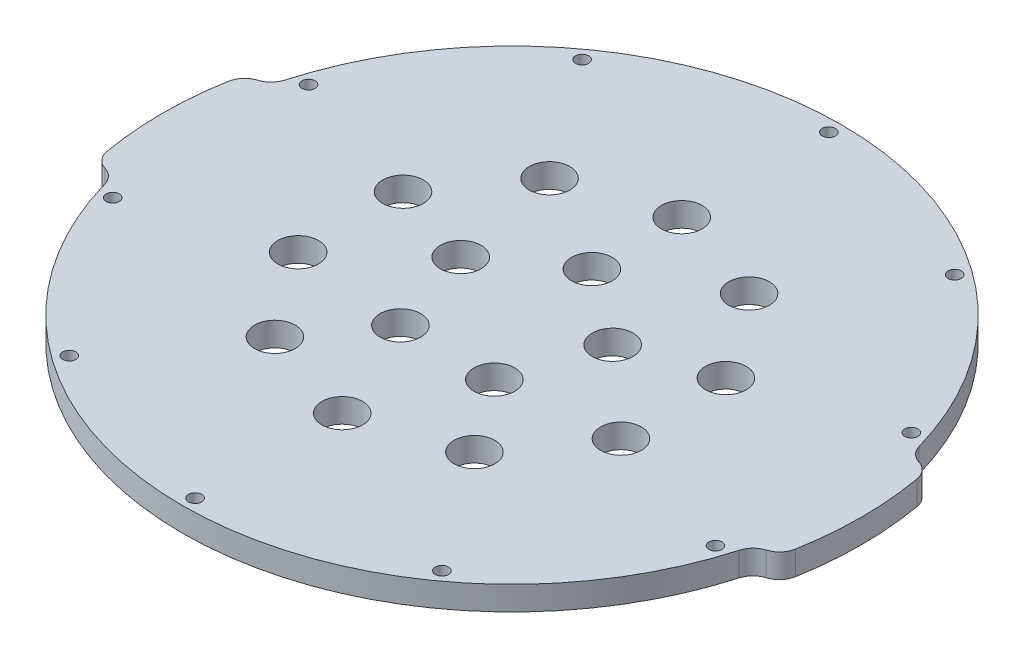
ISO-10303-21;
HEADER;
FILE_DESCRIPTION(('STEP AP214'),'2;1');
FILE_NAME('part.step','',(''),(''),'','','');
FILE_SCHEMA(('AUTOMOTIVE_DESIGN { 1 0 10303 214 1 1 1 1 }'));
ENDSEC;
DATA;
#1=APPLICATION_CONTEXT('core data for automotive mechanical design processes');
#2=APPLICATION_PROTOCOL_DEFINITION('international standard','automotive_design',2000,#1);
#3=PRODUCT_CONTEXT('',#1,'mechanical');
#4=PRODUCT('Part','Part','',(#3));
#5=PRODUCT_RELATED_PRODUCT_CATEGORY('part','',(#4));
#6=PRODUCT_DEFINITION_FORMATION('','',#4);
#7=PRODUCT_DEFINITION_CONTEXT('part definition',#1,'design');
#8=PRODUCT_DEFINITION('design','',#6,#7);
#9=PRODUCT_DEFINITION_SHAPE('','',#8);
#10=(LENGTH_UNIT() NAMED_UNIT(*) SI_UNIT(.MILLI.,.METRE.));
#11=(NAMED_UNIT(*) PLANE_ANGLE_UNIT() SI_UNIT($,.RADIAN.));
#12=(NAMED_UNIT(*) SI_UNIT($,.STERADIAN.) SOLID_ANGLE_UNIT());
#13=UNCERTAINTY_MEASURE_WITH_UNIT(LENGTH_MEASURE(1.E-05),#10,'distance_accuracy_value','');
#14=(GEOMETRIC_REPRESENTATION_CONTEXT(3) GLOBAL_UNCERTAINTY_ASSIGNED_CONTEXT((#13)) GLOBAL_UNIT_ASSIGNED_CONTEXT((#10,
#11,#12)) REPRESENTATION_CONTEXT('',''));
#15=CARTESIAN_POINT('',(0.,0.,0.));
#16=DIRECTION('',(0.,0.,1.));
#17=DIRECTION('',(1.,0.,0.));
#18=AXIS2_PLACEMENT_3D('',#15,#16,#17);
#19=CARTESIAN_POINT('',(-40.6479400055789,6.,-7.16732853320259));
#20=DIRECTION('',(0.,-1.,0.));
#21=DIRECTION('',(0.,0.,-1.));
#22=AXIS2_PLACEMENT_3D('',#19,#20,#21);
#23=PLANE('',#22);
#24=CARTESIAN_POINT('',(19.0211303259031,6.,-6.18033988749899));
#25=DIRECTION('',(0.,1.,0.));
#26=DIRECTION('',(0.,0.,1.));
#27=AXIS2_PLACEMENT_3D('',#24,#25,#26);
#28=CIRCLE('',#27,5.1);
#29=CARTESIAN_POINT('',(19.0211303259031,6.,-1.08033988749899));
#30=VERTEX_POINT('',#29);
#31=EDGE_CURVE('E456',#30,#30,#28,.T.);
#32=ORIENTED_EDGE('',*,*,#31,.F.);
#33=EDGE_LOOP('',(#32));
#34=FACE_BOUND('',#33,.T.);
#35=CARTESIAN_POINT('',(0.,6.,-20.));
#36=DIRECTION('',(0.,1.,0.));
#37=DIRECTION('',(0.,0.,1.));
#38=AXIS2_PLACEMENT_3D('',#35,#36,#37);
#39=CIRCLE('',#38,5.1);
#40=CARTESIAN_POINT('',(0.,6.,-14.9));
#41=VERTEX_POINT('',#40);
#42=EDGE_CURVE('E450',#41,#41,#39,.T.);
#43=ORIENTED_EDGE('',*,*,#42,.F.);
#44=EDGE_LOOP('',(#43));
#45=FACE_BOUND('',#44,.T.);
#46=CARTESIAN_POINT('',(-19.0211303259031,6.,-6.1803398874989));
#47=DIRECTION('',(0.,1.,0.));
#48=DIRECTION('',(0.,0.,1.));
#49=AXIS2_PLACEMENT_3D('',#46,#47,#48);
#50=CIRCLE('',#49,5.1);
#51=CARTESIAN_POINT('',(-19.0211303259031,6.,-1.08033988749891));
#52=VERTEX_POINT('',#51);
#53=EDGE_CURVE('E444',#52,#52,#50,.T.);
#54=ORIENTED_EDGE('',*,*,#53,.F.);
#55=EDGE_LOOP('',(#54));
#56=FACE_BOUND('',#55,.T.);
#57=CARTESIAN_POINT('',(-11.7557050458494,6.,16.180339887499));
#58=DIRECTION('',(0.,1.,0.));
#59=DIRECTION('',(0.,0.,1.));
#60=AXIS2_PLACEMENT_3D('',#57,#58,#59);
#61=CIRCLE('',#60,5.1);
#62=CARTESIAN_POINT('',(-11.7557050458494,6.,21.280339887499));
#63=VERTEX_POINT('',#62);
#64=EDGE_CURVE('E438',#63,#63,#61,.T.);
#65=ORIENTED_EDGE('',*,*,#64,.F.);
#66=EDGE_LOOP('',(#65));
#67=FACE_BOUND('',#66,.T.);
#68=CARTESIAN_POINT('',(-24.9808732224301,6.,-34.3832222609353));
#69=DIRECTION('',(0.,1.,0.));
#70=DIRECTION('',(0.,0.,1.));
#71=AXIS2_PLACEMENT_3D('',#68,#69,#70);
#72=CIRCLE('',#71,5.1);
#73=CARTESIAN_POINT('',(-24.9808732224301,6.,-29.2832222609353));
#74=VERTEX_POINT('',#73);
#75=EDGE_CURVE('E432',#74,#74,#72,.T.);
#76=ORIENTED_EDGE('',*,*,#75,.F.);
#77=EDGE_LOOP('',(#76));
#78=FACE_BOUND('',#77,.T.);
#79=CARTESIAN_POINT('',(-40.419901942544,6.,-13.1332222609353));
#80=DIRECTION('',(0.,1.,0.));
#81=DIRECTION('',(0.,0.,1.));
#82=AXIS2_PLACEMENT_3D('',#79,#80,#81);
#83=CIRCLE('',#82,5.1);
#84=CARTESIAN_POINT('',(-40.419901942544,6.,-8.03322226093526));
#85=VERTEX_POINT('',#84);
#86=EDGE_CURVE('E426',#85,#85,#83,.T.);
#87=ORIENTED_EDGE('',*,*,#86,.F.);
#88=EDGE_LOOP('',(#87));
#89=FACE_BOUND('',#88,.T.);
#90=CARTESIAN_POINT('',(-40.419901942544,6.,13.1332222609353));
#91=DIRECTION('',(0.,1.,0.));
#92=DIRECTION('',(0.,0.,1.));
#93=AXIS2_PLACEMENT_3D('',#90,#91,#92);
#94=CIRCLE('',#93,5.09999999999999);
#95=CARTESIAN_POINT('',(-40.419901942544,6.,18.2332222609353));
#96=VERTEX_POINT('',#95);
#97=EDGE_CURVE('E420',#96,#96,#94,.T.);
#98=ORIENTED_EDGE('',*,*,#97,.F.);
#99=EDGE_LOOP('',(#98));
#100=FACE_BOUND('',#99,.T.);
#101=CARTESIAN_POINT('',(-24.9808732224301,6.,34.3832222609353));
#102=DIRECTION('',(0.,1.,0.));
#103=DIRECTION('',(0.,0.,1.));
#104=AXIS2_PLACEMENT_3D('',#101,#102,#103);
#105=CIRCLE('',#104,5.1);
#106=CARTESIAN_POINT('',(-24.9808732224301,6.,39.4832222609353));
#107=VERTEX_POINT('',#106);
#108=EDGE_CURVE('E414',#107,#107,#105,.T.);
#109=ORIENTED_EDGE('',*,*,#108,.F.);
#110=EDGE_LOOP('',(#109));
#111=FACE_BOUND('',#110,.T.);
#112=CARTESIAN_POINT('',(0.,6.,42.5));
#113=DIRECTION('',(0.,1.,0.));
#114=DIRECTION('',(0.,0.,1.));
#115=AXIS2_PLACEMENT_3D('',#112,#113,#114);
#116=CIRCLE('',#115,5.1);
#117=CARTESIAN_POINT('',(0.,6.,47.6));
#118=VERTEX_POINT('',#117);
#119=EDGE_CURVE('E408',#118,#118,#116,.T.);
#120=ORIENTED_EDGE('',*,*,#119,.F.);
#121=EDGE_LOOP('',(#120));
#122=FACE_BOUND('',#121,.T.);
#123=CARTESIAN_POINT('',(11.7557050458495,6.,16.1803398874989));
#124=DIRECTION('',(0.,1.,0.));
#125=DIRECTION('',(0.,0.,1.));
#126=AXIS2_PLACEMENT_3D('',#123,#124,#125);
#127=CIRCLE('',#126,5.1);
#128=CARTESIAN_POINT('',(11.7557050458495,6.,21.2803398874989));
#129=VERTEX_POINT('',#128);
#130=EDGE_CURVE('E402',#129,#129,#127,.T.);
#131=ORIENTED_EDGE('',*,*,#130,.F.);
#132=EDGE_LOOP('',(#131));
#133=FACE_BOUND('',#132,.T.);
#134=CARTESIAN_POINT('',(24.9808732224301,6.,34.3832222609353));
#135=DIRECTION('',(0.,1.,0.));
#136=DIRECTION('',(0.,0.,1.));
#137=AXIS2_PLACEMENT_3D('',#134,#135,#136);
#138=CIRCLE('',#137,5.1);
#139=CARTESIAN_POINT('',(24.9808732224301,6.,39.4832222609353));
#140=VERTEX_POINT('',#139);
#141=EDGE_CURVE('E396',#140,#140,#138,.T.);
#142=ORIENTED_EDGE('',*,*,#141,.F.);
#143=EDGE_LOOP('',(#142));
#144=FACE_BOUND('',#143,.T.);
#145=CARTESIAN_POINT('',(40.419901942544,6.,13.1332222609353));
#146=DIRECTION('',(0.,1.,0.));
#147=DIRECTION('',(0.,0.,1.));
#148=AXIS2_PLACEMENT_3D('',#145,#146,#147);
#149=CIRCLE('',#148,5.10000000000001);
#150=CARTESIAN_POINT('',(40.419901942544,6.,18.2332222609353));
#151=VERTEX_POINT('',#150);
#152=EDGE_CURVE('E390',#151,#151,#149,.T.);
#153=ORIENTED_EDGE('',*,*,#152,.F.);
#154=EDGE_LOOP('',(#153));
#155=FACE_BOUND('',#154,.T.);
#156=CARTESIAN_POINT('',(40.419901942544,6.,-13.1332222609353));
#157=DIRECTION('',(0.,1.,0.));
#158=DIRECTION('',(0.,0.,1.));
#159=AXIS2_PLACEMENT_3D('',#156,#157,#158);
#160=CIRCLE('',#159,5.1);
#161=CARTESIAN_POINT('',(40.419901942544,6.,-8.03322226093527));
#162=VERTEX_POINT('',#161);
#163=EDGE_CURVE('E384',#162,#162,#160,.T.);
#164=ORIENTED_EDGE('',*,*,#163,.F.);
#165=EDGE_LOOP('',(#164));
#166=FACE_BOUND('',#165,.T.);
#167=CARTESIAN_POINT('',(24.9808732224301,6.,-34.3832222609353));
#168=DIRECTION('',(0.,1.,0.));
#169=DIRECTION('',(0.,0.,1.));
#170=AXIS2_PLACEMENT_3D('',#167,#168,#169);
#171=CIRCLE('',#170,5.1);
#172=CARTESIAN_POINT('',(24.9808732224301,6.,-29.2832222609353));
#173=VERTEX_POINT('',#172);
#174=EDGE_CURVE('E378',#173,#173,#171,.T.);
#175=ORIENTED_EDGE('',*,*,#174,.F.);
#176=EDGE_LOOP('',(#175));
#177=FACE_BOUND('',#176,.T.);
#178=CARTESIAN_POINT('',(0.,6.,-42.5));
#179=DIRECTION('',(0.,1.,0.));
#180=DIRECTION('',(0.,0.,1.));
#181=AXIS2_PLACEMENT_3D('',#178,#179,#180);
#182=CIRCLE('',#181,5.1);
#183=CARTESIAN_POINT('',(0.,6.,-37.4));
#184=VERTEX_POINT('',#183);
#185=EDGE_CURVE('E372',#184,#184,#182,.T.);
#186=ORIENTED_EDGE('',*,*,#185,.F.);
#187=EDGE_LOOP('',(#186));
#188=FACE_BOUND('',#187,.T.);
#189=CARTESIAN_POINT('',(-75.4663345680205,6.,-24.5204985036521));
#190=DIRECTION('',(0.,1.,0.));
#191=DIRECTION('',(0.,0.,1.));
#192=AXIS2_PLACEMENT_3D('',#189,#190,#191);
#193=CIRCLE('',#192,1.6500000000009);
#194=CARTESIAN_POINT('',(-75.4663345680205,6.,-22.8704985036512));
#195=VERTEX_POINT('',#194);
#196=EDGE_CURVE('E357',#195,#195,#193,.T.);
#197=ORIENTED_EDGE('',*,*,#196,.F.);
#198=EDGE_LOOP('',(#197));
#199=FACE_BOUND('',#198,.T.);
#200=CARTESIAN_POINT('',(-46.6407597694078,6.,64.1954985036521));
#201=DIRECTION('',(0.,1.,0.));
#202=DIRECTION('',(0.,0.,1.));
#203=AXIS2_PLACEMENT_3D('',#200,#201,#202);
#204=CIRCLE('',#203,1.65000000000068);
#205=CARTESIAN_POINT('',(-46.6407597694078,6.,65.8454985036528));
#206=VERTEX_POINT('',#205);
#207=EDGE_CURVE('E345',#206,#206,#204,.T.);
#208=ORIENTED_EDGE('',*,*,#207,.F.);
#209=EDGE_LOOP('',(#208));
#210=FACE_BOUND('',#209,.T.);
#211=CARTESIAN_POINT('',(46.6407597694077,6.,64.1954985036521));
#212=DIRECTION('',(0.,1.,0.));
#213=DIRECTION('',(0.,0.,1.));
#214=AXIS2_PLACEMENT_3D('',#211,#212,#213);
#215=CIRCLE('',#214,1.65000000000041);
#216=CARTESIAN_POINT('',(46.6407597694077,6.,65.8454985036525));
#217=VERTEX_POINT('',#216);
#218=EDGE_CURVE('E333',#217,#217,#215,.T.);
#219=ORIENTED_EDGE('',*,*,#218,.F.);
#220=EDGE_LOOP('',(#219));
#221=FACE_BOUND('',#220,.T.);
#222=CARTESIAN_POINT('',(75.4663345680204,6.,-24.5204985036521));
#223=DIRECTION('',(0.,1.,0.));
#224=DIRECTION('',(0.,0.,1.));
#225=AXIS2_PLACEMENT_3D('',#222,#223,#224);
#226=CIRCLE('',#225,1.65000000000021);
#227=CARTESIAN_POINT('',(75.4663345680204,6.,-22.8704985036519));
#228=VERTEX_POINT('',#227);
#229=EDGE_CURVE('E321',#228,#228,#226,.T.);
#230=ORIENTED_EDGE('',*,*,#229,.F.);
#231=EDGE_LOOP('',(#230));
#232=FACE_BOUND('',#231,.T.);
#233=CARTESIAN_POINT('',(0.,6.,-79.35));
#234=DIRECTION('',(0.,1.,0.));
#235=DIRECTION('',(0.,0.,1.));
#236=AXIS2_PLACEMENT_3D('',#233,#234,#235);
#237=CIRCLE('',#236,1.65);
#238=CARTESIAN_POINT('',(0.,6.,-77.7));
#239=VERTEX_POINT('',#238);
#240=EDGE_CURVE('E289',#239,#239,#237,.T.);
#241=ORIENTED_EDGE('',*,*,#240,.F.);
#242=EDGE_LOOP('',(#241));
#243=FACE_BOUND('',#242,.T.);
#244=CARTESIAN_POINT('',(0.,6.,0.));
#245=DIRECTION('',(0.,1.,0.));
#246=DIRECTION('',(0.,0.,-1.));
#247=AXIS2_PLACEMENT_3D('',#244,#245,#246);
#248=CIRCLE('',#247,82.55);
#249=CARTESIAN_POINT('',(79.4156922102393,6.,-22.5310969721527));
#250=VERTEX_POINT('',#249);
#251=CARTESIAN_POINT('',(-79.4156922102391,6.,-22.531096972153));
#252=VERTEX_POINT('',#251);
#253=EDGE_CURVE('E284',#250,#252,#248,.T.);
#254=ORIENTED_EDGE('',*,*,#253,.T.);
#255=CARTESIAN_POINT('',(-84.2258492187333,6.,-23.8957909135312));
#256=DIRECTION('',(0.,-1.,0.));
#257=DIRECTION('',(0.,0.,-1.));
#258=AXIS2_PLACEMENT_3D('',#255,#256,#257);
#259=CIRCLE('',#258,5.);
#260=CARTESIAN_POINT('',(-82.7608646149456,6.,-19.1152239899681));
#261=VERTEX_POINT('',#260);
#262=EDGE_CURVE('E139',#252,#261,#259,.T.);
#263=ORIENTED_EDGE('',*,*,#262,.T.);
#264=CARTESIAN_POINT('',(-81.2958800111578,6.,-14.3346570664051));
#265=DIRECTION('',(0.,1.,0.));
#266=DIRECTION('',(0.,0.,-1.));
#267=AXIS2_PLACEMENT_3D('',#264,#265,#266);
#268=CIRCLE('',#267,5.00000000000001);
#269=CARTESIAN_POINT('',(-86.2199187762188,6.,-15.2028979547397));
#270=VERTEX_POINT('',#269);
#271=EDGE_CURVE('E132',#261,#270,#268,.T.);
#272=ORIENTED_EDGE('',*,*,#271,.T.);
#273=CARTESIAN_POINT('',(0.,6.,0.));
#274=DIRECTION('',(0.,1.,0.));
#275=DIRECTION('',(0.,0.,-1.));
#276=AXIS2_PLACEMENT_3D('',#273,#274,#275);
#277=CIRCLE('',#276,87.55);
#278=CARTESIAN_POINT('',(-86.2199187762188,6.,15.2028979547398));
#279=VERTEX_POINT('',#278);
#280=EDGE_CURVE('E136',#270,#279,#277,.T.);
#281=ORIENTED_EDGE('',*,*,#280,.T.);
#282=CARTESIAN_POINT('',(-81.2958800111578,6.,14.3346570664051));
#283=DIRECTION('',(0.,1.,0.));
#284=DIRECTION('',(0.,0.,1.));
#285=AXIS2_PLACEMENT_3D('',#282,#283,#284);
#286=CIRCLE('',#285,5.00000000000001);
#287=CARTESIAN_POINT('',(-82.7608646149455,6.,19.1152239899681));
#288=VERTEX_POINT('',#287);
#289=EDGE_CURVE('E152',#279,#288,#286,.T.);
#290=ORIENTED_EDGE('',*,*,#289,.T.);
#291=CARTESIAN_POINT('',(-84.2258492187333,6.,23.8957909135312));
#292=DIRECTION('',(0.,-1.,0.));
#293=DIRECTION('',(0.,0.,-1.));
#294=AXIS2_PLACEMENT_3D('',#291,#292,#293);
#295=CIRCLE('',#294,5.);
#296=CARTESIAN_POINT('',(-79.4156922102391,6.,22.531096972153));
#297=VERTEX_POINT('',#296);
#298=EDGE_CURVE('E13',#288,#297,#295,.T.);
#299=ORIENTED_EDGE('',*,*,#298,.T.);
#300=CARTESIAN_POINT('',(0.,6.,-4.92661467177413E-13));
#301=DIRECTION('',(0.,1.,0.));
#302=DIRECTION('',(0.,0.,-1.));
#303=AXIS2_PLACEMENT_3D('',#300,#301,#302);
#304=CIRCLE('',#303,82.5500000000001);
#305=CARTESIAN_POINT('',(79.4156922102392,6.,22.5310969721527));
#306=VERTEX_POINT('',#305);
#307=EDGE_CURVE('E271',#297,#306,#304,.T.);
#308=ORIENTED_EDGE('',*,*,#307,.T.);
#309=CARTESIAN_POINT('',(84.2258492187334,6.,23.8957909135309));
#310=DIRECTION('',(0.,-1.,0.));
#311=DIRECTION('',(0.,0.,-1.));
#312=AXIS2_PLACEMENT_3D('',#309,#310,#311);
#313=CIRCLE('',#312,5.);
#314=CARTESIAN_POINT('',(82.7608646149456,6.,19.1152239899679));
#315=VERTEX_POINT('',#314);
#316=EDGE_CURVE('E183',#306,#315,#313,.T.);
#317=ORIENTED_EDGE('',*,*,#316,.T.);
#318=CARTESIAN_POINT('',(81.2958800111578,6.,14.3346570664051));
#319=DIRECTION('',(0.,1.,0.));
#320=DIRECTION('',(0.,0.,-1.));
#321=AXIS2_PLACEMENT_3D('',#318,#319,#320);
#322=CIRCLE('',#321,4.99999999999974);
#323=CARTESIAN_POINT('',(86.2199187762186,6.,15.2028979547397));
#324=VERTEX_POINT('',#323);
#325=EDGE_CURVE('E268',#315,#324,#322,.T.);
#326=ORIENTED_EDGE('',*,*,#325,.T.);
#327=CARTESIAN_POINT('',(-1.29063426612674E-12,6.,0.));
#328=DIRECTION('',(0.,1.,0.));
#329=DIRECTION('',(0.,0.,1.));
#330=AXIS2_PLACEMENT_3D('',#327,#328,#329);
#331=CIRCLE('',#330,87.550000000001);
#332=CARTESIAN_POINT('',(86.2199187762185,6.,-15.2028979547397));
#333=VERTEX_POINT('',#332);
#334=EDGE_CURVE('E275',#324,#333,#331,.T.);
#335=ORIENTED_EDGE('',*,*,#334,.T.);
#336=CARTESIAN_POINT('',(81.2958800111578,6.,-14.3346570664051));
#337=DIRECTION('',(0.,1.,0.));
#338=DIRECTION('',(0.,0.,1.));
#339=AXIS2_PLACEMENT_3D('',#336,#337,#338);
#340=CIRCLE('',#339,4.99999999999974);
#341=CARTESIAN_POINT('',(82.7608646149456,6.,-19.1152239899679));
#342=VERTEX_POINT('',#341);
#343=EDGE_CURVE('E277',#333,#342,#340,.T.);
#344=ORIENTED_EDGE('',*,*,#343,.T.);
#345=CARTESIAN_POINT('',(84.2258492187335,6.,-23.8957909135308));
#346=DIRECTION('',(0.,-1.,0.));
#347=DIRECTION('',(0.,0.,-1.));
#348=AXIS2_PLACEMENT_3D('',#345,#346,#347);
#349=CIRCLE('',#348,5.);
#350=EDGE_CURVE('E187',#342,#250,#349,.T.);
#351=ORIENTED_EDGE('',*,*,#350,.T.);
#352=EDGE_LOOP('',(#254,#263,#272,#281,#290,#299,#308,#317,#326,#335,#344,#351));
#353=FACE_BOUND('',#352,.T.);
#354=CARTESIAN_POINT('',(46.6407597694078,6.,-64.1954985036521));
#355=DIRECTION('',(0.,1.,0.));
#356=DIRECTION('',(0.,0.,1.));
#357=AXIS2_PLACEMENT_3D('',#354,#355,#356);
#358=CIRCLE('',#357,1.65000000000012);
#359=CARTESIAN_POINT('',(46.6407597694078,6.,-62.5454985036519));
#360=VERTEX_POINT('',#359);
#361=EDGE_CURVE('E315',#360,#360,#358,.T.);
#362=ORIENTED_EDGE('',*,*,#361,.F.);
#363=EDGE_LOOP('',(#362));
#364=FACE_BOUND('',#363,.T.);
#365=CARTESIAN_POINT('',(75.4663345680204,6.,24.5204985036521));
#366=DIRECTION('',(0.,1.,0.));
#367=DIRECTION('',(0.,0.,1.));
#368=AXIS2_PLACEMENT_3D('',#365,#366,#367);
#369=CIRCLE('',#368,1.65000000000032);
#370=CARTESIAN_POINT('',(75.4663345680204,6.,26.1704985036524));
#371=VERTEX_POINT('',#370);
#372=EDGE_CURVE('E327',#371,#371,#369,.T.);
#373=ORIENTED_EDGE('',*,*,#372,.F.);
#374=EDGE_LOOP('',(#373));
#375=FACE_BOUND('',#374,.T.);
#376=CARTESIAN_POINT('',(0.,6.,79.35));
#377=DIRECTION('',(0.,1.,0.));
#378=DIRECTION('',(0.,0.,1.));
#379=AXIS2_PLACEMENT_3D('',#376,#377,#378);
#380=CIRCLE('',#379,1.65000000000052);
#381=CARTESIAN_POINT('',(0.,6.,81.0000000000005));
#382=VERTEX_POINT('',#381);
#383=EDGE_CURVE('E339',#382,#382,#380,.T.);
#384=ORIENTED_EDGE('',*,*,#383,.F.);
#385=EDGE_LOOP('',(#384));
#386=FACE_BOUND('',#385,.T.);
#387=CARTESIAN_POINT('',(-75.4663345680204,6.,24.5204985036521));
#388=DIRECTION('',(0.,1.,0.));
#389=DIRECTION('',(0.,0.,1.));
#390=AXIS2_PLACEMENT_3D('',#387,#388,#389);
#391=CIRCLE('',#390,1.65000000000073);
#392=CARTESIAN_POINT('',(-75.4663345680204,6.,26.1704985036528));
#393=VERTEX_POINT('',#392);
#394=EDGE_CURVE('E351',#393,#393,#391,.T.);
#395=ORIENTED_EDGE('',*,*,#394,.F.);
#396=EDGE_LOOP('',(#395));
#397=FACE_BOUND('',#396,.T.);
#398=CARTESIAN_POINT('',(-46.6407597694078,6.,-64.1954985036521));
#399=DIRECTION('',(0.,1.,0.));
#400=DIRECTION('',(0.,0.,1.));
#401=AXIS2_PLACEMENT_3D('',#398,#399,#400);
#402=CIRCLE('',#401,1.65000000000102);
#403=CARTESIAN_POINT('',(-46.6407597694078,6.,-62.545498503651));
#404=VERTEX_POINT('',#403);
#405=EDGE_CURVE('E363',#404,#404,#402,.T.);
#406=ORIENTED_EDGE('',*,*,#405,.F.);
#407=EDGE_LOOP('',(#406));
#408=FACE_BOUND('',#407,.T.);
#409=ADVANCED_FACE('F44',(#34,#45,#56,#67,#78,#89,#100,#111,#122,#133,#144,#155,#166,#177,#188,
#199,#210,#221,#232,#243,#353,#364,#375,#386,#397,#408),#23,.F.);
#410=CARTESIAN_POINT('',(-40.6479400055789,0.,-7.16732853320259));
#411=DIRECTION('',(0.,-1.,0.));
#412=DIRECTION('',(0.,0.,-1.));
#413=AXIS2_PLACEMENT_3D('',#410,#411,#412);
#414=PLANE('',#413);
#415=CARTESIAN_POINT('',(19.0211303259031,0.,-6.18033988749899));
#416=DIRECTION('',(0.,1.,0.));
#417=DIRECTION('',(0.,0.,1.));
#418=AXIS2_PLACEMENT_3D('',#415,#416,#417);
#419=CIRCLE('',#418,5.1);
#420=CARTESIAN_POINT('',(19.0211303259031,0.,-1.08033988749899));
#421=VERTEX_POINT('',#420);
#422=EDGE_CURVE('E453',#421,#421,#419,.T.);
#423=ORIENTED_EDGE('',*,*,#422,.T.);
#424=EDGE_LOOP('',(#423));
#425=FACE_BOUND('',#424,.T.);
#426=CARTESIAN_POINT('',(0.,0.,-20.));
#427=DIRECTION('',(0.,1.,0.));
#428=DIRECTION('',(0.,0.,1.));
#429=AXIS2_PLACEMENT_3D('',#426,#427,#428);
#430=CIRCLE('',#429,5.1);
#431=CARTESIAN_POINT('',(0.,0.,-14.9));
#432=VERTEX_POINT('',#431);
#433=EDGE_CURVE('E447',#432,#432,#430,.T.);
#434=ORIENTED_EDGE('',*,*,#433,.T.);
#435=EDGE_LOOP('',(#434));
#436=FACE_BOUND('',#435,.T.);
#437=CARTESIAN_POINT('',(-19.0211303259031,0.,-6.1803398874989));
#438=DIRECTION('',(0.,1.,0.));
#439=DIRECTION('',(0.,0.,1.));
#440=AXIS2_PLACEMENT_3D('',#437,#438,#439);
#441=CIRCLE('',#440,5.1);
#442=CARTESIAN_POINT('',(-19.0211303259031,0.,-1.08033988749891));
#443=VERTEX_POINT('',#442);
#444=EDGE_CURVE('E441',#443,#443,#441,.T.);
#445=ORIENTED_EDGE('',*,*,#444,.T.);
#446=EDGE_LOOP('',(#445));
#447=FACE_BOUND('',#446,.T.);
#448=CARTESIAN_POINT('',(-11.7557050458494,0.,16.180339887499));
#449=DIRECTION('',(0.,1.,0.));
#450=DIRECTION('',(0.,0.,1.));
#451=AXIS2_PLACEMENT_3D('',#448,#449,#450);
#452=CIRCLE('',#451,5.1);
#453=CARTESIAN_POINT('',(-11.7557050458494,0.,21.280339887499));
#454=VERTEX_POINT('',#453);
#455=EDGE_CURVE('E435',#454,#454,#452,.T.);
#456=ORIENTED_EDGE('',*,*,#455,.T.);
#457=EDGE_LOOP('',(#456));
#458=FACE_BOUND('',#457,.T.);
#459=CARTESIAN_POINT('',(-24.9808732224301,0.,-34.3832222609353));
#460=DIRECTION('',(0.,1.,0.));
#461=DIRECTION('',(0.,0.,1.));
#462=AXIS2_PLACEMENT_3D('',#459,#460,#461);
#463=CIRCLE('',#462,5.1);
#464=CARTESIAN_POINT('',(-24.9808732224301,0.,-29.2832222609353));
#465=VERTEX_POINT('',#464);
#466=EDGE_CURVE('E429',#465,#465,#463,.T.);
#467=ORIENTED_EDGE('',*,*,#466,.T.);
#468=EDGE_LOOP('',(#467));
#469=FACE_BOUND('',#468,.T.);
#470=CARTESIAN_POINT('',(-40.419901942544,0.,-13.1332222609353));
#471=DIRECTION('',(0.,1.,0.));
#472=DIRECTION('',(0.,0.,1.));
#473=AXIS2_PLACEMENT_3D('',#470,#471,#472);
#474=CIRCLE('',#473,5.1);
#475=CARTESIAN_POINT('',(-40.419901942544,0.,-8.03322226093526));
#476=VERTEX_POINT('',#475);
#477=EDGE_CURVE('E423',#476,#476,#474,.T.);
#478=ORIENTED_EDGE('',*,*,#477,.T.);
#479=EDGE_LOOP('',(#478));
#480=FACE_BOUND('',#479,.T.);
#481=CARTESIAN_POINT('',(-40.419901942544,0.,13.1332222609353));
#482=DIRECTION('',(0.,1.,0.));
#483=DIRECTION('',(0.,0.,1.));
#484=AXIS2_PLACEMENT_3D('',#481,#482,#483);
#485=CIRCLE('',#484,5.09999999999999);
#486=CARTESIAN_POINT('',(-40.419901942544,0.,18.2332222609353));
#487=VERTEX_POINT('',#486);
#488=EDGE_CURVE('E417',#487,#487,#485,.T.);
#489=ORIENTED_EDGE('',*,*,#488,.T.);
#490=EDGE_LOOP('',(#489));
#491=FACE_BOUND('',#490,.T.);
#492=CARTESIAN_POINT('',(-24.9808732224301,0.,34.3832222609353));
#493=DIRECTION('',(0.,1.,0.));
#494=DIRECTION('',(0.,0.,1.));
#495=AXIS2_PLACEMENT_3D('',#492,#493,#494);
#496=CIRCLE('',#495,5.1);
#497=CARTESIAN_POINT('',(-24.9808732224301,0.,39.4832222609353));
#498=VERTEX_POINT('',#497);
#499=EDGE_CURVE('E411',#498,#498,#496,.T.);
#500=ORIENTED_EDGE('',*,*,#499,.T.);
#501=EDGE_LOOP('',(#500));
#502=FACE_BOUND('',#501,.T.);
#503=CARTESIAN_POINT('',(0.,0.,42.5));
#504=DIRECTION('',(0.,1.,0.));
#505=DIRECTION('',(0.,0.,1.));
#506=AXIS2_PLACEMENT_3D('',#503,#504,#505);
#507=CIRCLE('',#506,5.1);
#508=CARTESIAN_POINT('',(0.,0.,47.6));
#509=VERTEX_POINT('',#508);
#510=EDGE_CURVE('E405',#509,#509,#507,.T.);
#511=ORIENTED_EDGE('',*,*,#510,.T.);
#512=EDGE_LOOP('',(#511));
#513=FACE_BOUND('',#512,.T.);
#514=CARTESIAN_POINT('',(11.7557050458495,0.,16.1803398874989));
#515=DIRECTION('',(0.,1.,0.));
#516=DIRECTION('',(0.,0.,1.));
#517=AXIS2_PLACEMENT_3D('',#514,#515,#516);
#518=CIRCLE('',#517,5.1);
#519=CARTESIAN_POINT('',(11.7557050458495,0.,21.2803398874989));
#520=VERTEX_POINT('',#519);
#521=EDGE_CURVE('E399',#520,#520,#518,.T.);
#522=ORIENTED_EDGE('',*,*,#521,.T.);
#523=EDGE_LOOP('',(#522));
#524=FACE_BOUND('',#523,.T.);
#525=CARTESIAN_POINT('',(24.9808732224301,0.,34.3832222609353));
#526=DIRECTION('',(0.,1.,0.));
#527=DIRECTION('',(0.,0.,1.));
#528=AXIS2_PLACEMENT_3D('',#525,#526,#527);
#529=CIRCLE('',#528,5.1);
#530=CARTESIAN_POINT('',(24.9808732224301,0.,39.4832222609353));
#531=VERTEX_POINT('',#530);
#532=EDGE_CURVE('E393',#531,#531,#529,.T.);
#533=ORIENTED_EDGE('',*,*,#532,.T.);
#534=EDGE_LOOP('',(#533));
#535=FACE_BOUND('',#534,.T.);
#536=CARTESIAN_POINT('',(40.419901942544,0.,13.1332222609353));
#537=DIRECTION('',(0.,1.,0.));
#538=DIRECTION('',(0.,0.,1.));
#539=AXIS2_PLACEMENT_3D('',#536,#537,#538);
#540=CIRCLE('',#539,5.10000000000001);
#541=CARTESIAN_POINT('',(40.419901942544,0.,18.2332222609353));
#542=VERTEX_POINT('',#541);
#543=EDGE_CURVE('E387',#542,#542,#540,.T.);
#544=ORIENTED_EDGE('',*,*,#543,.T.);
#545=EDGE_LOOP('',(#544));
#546=FACE_BOUND('',#545,.T.);
#547=CARTESIAN_POINT('',(40.419901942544,0.,-13.1332222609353));
#548=DIRECTION('',(0.,1.,0.));
#549=DIRECTION('',(0.,0.,1.));
#550=AXIS2_PLACEMENT_3D('',#547,#548,#549);
#551=CIRCLE('',#550,5.1);
#552=CARTESIAN_POINT('',(40.419901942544,0.,-8.03322226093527));
#553=VERTEX_POINT('',#552);
#554=EDGE_CURVE('E381',#553,#553,#551,.T.);
#555=ORIENTED_EDGE('',*,*,#554,.T.);
#556=EDGE_LOOP('',(#555));
#557=FACE_BOUND('',#556,.T.);
#558=CARTESIAN_POINT('',(24.9808732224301,0.,-34.3832222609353));
#559=DIRECTION('',(0.,1.,0.));
#560=DIRECTION('',(0.,0.,1.));
#561=AXIS2_PLACEMENT_3D('',#558,#559,#560);
#562=CIRCLE('',#561,5.1);
#563=CARTESIAN_POINT('',(24.9808732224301,0.,-29.2832222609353));
#564=VERTEX_POINT('',#563);
#565=EDGE_CURVE('E375',#564,#564,#562,.T.);
#566=ORIENTED_EDGE('',*,*,#565,.T.);
#567=EDGE_LOOP('',(#566));
#568=FACE_BOUND('',#567,.T.);
#569=CARTESIAN_POINT('',(0.,0.,-42.5));
#570=DIRECTION('',(0.,1.,0.));
#571=DIRECTION('',(0.,0.,1.));
#572=AXIS2_PLACEMENT_3D('',#569,#570,#571);
#573=CIRCLE('',#572,5.1);
#574=CARTESIAN_POINT('',(0.,0.,-37.4));
#575=VERTEX_POINT('',#574);
#576=EDGE_CURVE('E369',#575,#575,#573,.T.);
#577=ORIENTED_EDGE('',*,*,#576,.T.);
#578=EDGE_LOOP('',(#577));
#579=FACE_BOUND('',#578,.T.);
#580=CARTESIAN_POINT('',(-75.4663345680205,0.,-24.5204985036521));
#581=DIRECTION('',(0.,1.,0.));
#582=DIRECTION('',(0.,0.,1.));
#583=AXIS2_PLACEMENT_3D('',#580,#581,#582);
#584=CIRCLE('',#583,1.6500000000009);
#585=CARTESIAN_POINT('',(-75.4663345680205,0.,-22.8704985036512));
#586=VERTEX_POINT('',#585);
#587=EDGE_CURVE('E360',#586,#586,#584,.T.);
#588=ORIENTED_EDGE('',*,*,#587,.T.);
#589=EDGE_LOOP('',(#588));
#590=FACE_BOUND('',#589,.T.);
#591=CARTESIAN_POINT('',(-46.6407597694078,0.,64.1954985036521));
#592=DIRECTION('',(0.,1.,0.));
#593=DIRECTION('',(0.,0.,1.));
#594=AXIS2_PLACEMENT_3D('',#591,#592,#593);
#595=CIRCLE('',#594,1.65000000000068);
#596=CARTESIAN_POINT('',(-46.6407597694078,0.,65.8454985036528));
#597=VERTEX_POINT('',#596);
#598=EDGE_CURVE('E348',#597,#597,#595,.T.);
#599=ORIENTED_EDGE('',*,*,#598,.T.);
#600=EDGE_LOOP('',(#599));
#601=FACE_BOUND('',#600,.T.);
#602=CARTESIAN_POINT('',(46.6407597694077,0.,64.1954985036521));
#603=DIRECTION('',(0.,1.,0.));
#604=DIRECTION('',(0.,0.,1.));
#605=AXIS2_PLACEMENT_3D('',#602,#603,#604);
#606=CIRCLE('',#605,1.65000000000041);
#607=CARTESIAN_POINT('',(46.6407597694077,0.,65.8454985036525));
#608=VERTEX_POINT('',#607);
#609=EDGE_CURVE('E336',#608,#608,#606,.T.);
#610=ORIENTED_EDGE('',*,*,#609,.T.);
#611=EDGE_LOOP('',(#610));
#612=FACE_BOUND('',#611,.T.);
#613=CARTESIAN_POINT('',(75.4663345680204,0.,-24.5204985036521));
#614=DIRECTION('',(0.,1.,0.));
#615=DIRECTION('',(0.,0.,1.));
#616=AXIS2_PLACEMENT_3D('',#613,#614,#615);
#617=CIRCLE('',#616,1.65000000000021);
#618=CARTESIAN_POINT('',(75.4663345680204,0.,-22.8704985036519));
#619=VERTEX_POINT('',#618);
#620=EDGE_CURVE('E324',#619,#619,#617,.T.);
#621=ORIENTED_EDGE('',*,*,#620,.T.);
#622=EDGE_LOOP('',(#621));
#623=FACE_BOUND('',#622,.T.);
#624=CARTESIAN_POINT('',(0.,0.,-79.35));
#625=DIRECTION('',(0.,1.,0.));
#626=DIRECTION('',(0.,0.,1.));
#627=AXIS2_PLACEMENT_3D('',#624,#625,#626);
#628=CIRCLE('',#627,1.65);
#629=CARTESIAN_POINT('',(0.,0.,-77.7));
#630=VERTEX_POINT('',#629);
#631=EDGE_CURVE('E312',#630,#630,#628,.T.);
#632=ORIENTED_EDGE('',*,*,#631,.T.);
#633=EDGE_LOOP('',(#632));
#634=FACE_BOUND('',#633,.T.);
#635=CARTESIAN_POINT('',(-81.2958800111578,0.,-14.3346570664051));
#636=DIRECTION('',(0.,1.,0.));
#637=DIRECTION('',(0.,0.,-1.));
#638=AXIS2_PLACEMENT_3D('',#635,#636,#637);
#639=CIRCLE('',#638,5.00000000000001);
#640=CARTESIAN_POINT('',(-82.7608646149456,0.,-19.1152239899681));
#641=VERTEX_POINT('',#640);
#642=CARTESIAN_POINT('',(-86.2199187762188,0.,-15.2028979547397));
#643=VERTEX_POINT('',#642);
#644=EDGE_CURVE('E156',#641,#643,#639,.T.);
#645=ORIENTED_EDGE('',*,*,#644,.F.);
#646=CARTESIAN_POINT('',(-84.2258492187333,0.,-23.8957909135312));
#647=DIRECTION('',(0.,-1.,0.));
#648=DIRECTION('',(0.,0.,-1.));
#649=AXIS2_PLACEMENT_3D('',#646,#647,#648);
#650=CIRCLE('',#649,5.);
#651=CARTESIAN_POINT('',(-79.4156922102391,0.,-22.531096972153));
#652=VERTEX_POINT('',#651);
#653=EDGE_CURVE('E189',#641,#652,#650,.F.);
#654=ORIENTED_EDGE('',*,*,#653,.T.);
#655=CARTESIAN_POINT('',(0.,0.,0.));
#656=DIRECTION('',(0.,1.,0.));
#657=DIRECTION('',(0.,0.,-1.));
#658=AXIS2_PLACEMENT_3D('',#655,#656,#657);
#659=CIRCLE('',#658,82.55);
#660=CARTESIAN_POINT('',(79.4156922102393,0.,-22.5310969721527));
#661=VERTEX_POINT('',#660);
#662=EDGE_CURVE('E144',#661,#652,#659,.T.);
#663=ORIENTED_EDGE('',*,*,#662,.F.);
#664=CARTESIAN_POINT('',(84.2258492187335,0.,-23.8957909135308));
#665=DIRECTION('',(0.,-1.,0.));
#666=DIRECTION('',(0.,0.,-1.));
#667=AXIS2_PLACEMENT_3D('',#664,#665,#666);
#668=CIRCLE('',#667,5.);
#669=CARTESIAN_POINT('',(82.7608646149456,0.,-19.1152239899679));
#670=VERTEX_POINT('',#669);
#671=EDGE_CURVE('E185',#661,#670,#668,.F.);
#672=ORIENTED_EDGE('',*,*,#671,.T.);
#673=CARTESIAN_POINT('',(81.2958800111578,0.,-14.3346570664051));
#674=DIRECTION('',(0.,1.,0.));
#675=DIRECTION('',(0.,0.,1.));
#676=AXIS2_PLACEMENT_3D('',#673,#674,#675);
#677=CIRCLE('',#676,4.99999999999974);
#678=CARTESIAN_POINT('',(86.2199187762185,0.,-15.2028979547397));
#679=VERTEX_POINT('',#678);
#680=EDGE_CURVE('E201',#679,#670,#677,.T.);
#681=ORIENTED_EDGE('',*,*,#680,.F.);
#682=CARTESIAN_POINT('',(-1.29063426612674E-12,0.,0.));
#683=DIRECTION('',(0.,1.,0.));
#684=DIRECTION('',(0.,0.,1.));
#685=AXIS2_PLACEMENT_3D('',#682,#683,#684);
#686=CIRCLE('',#685,87.550000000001);
#687=CARTESIAN_POINT('',(86.2199187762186,0.,15.2028979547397));
#688=VERTEX_POINT('',#687);
#689=EDGE_CURVE('E298',#688,#679,#686,.T.);
#690=ORIENTED_EDGE('',*,*,#689,.F.);
#691=CARTESIAN_POINT('',(81.2958800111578,0.,14.3346570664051));
#692=DIRECTION('',(0.,1.,0.));
#693=DIRECTION('',(0.,0.,-1.));
#694=AXIS2_PLACEMENT_3D('',#691,#692,#693);
#695=CIRCLE('',#694,4.99999999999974);
#696=CARTESIAN_POINT('',(82.7608646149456,0.,19.1152239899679));
#697=VERTEX_POINT('',#696);
#698=EDGE_CURVE('E296',#697,#688,#695,.T.);
#699=ORIENTED_EDGE('',*,*,#698,.F.);
#700=CARTESIAN_POINT('',(84.2258492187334,0.,23.8957909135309));
#701=DIRECTION('',(0.,-1.,0.));
#702=DIRECTION('',(0.,0.,-1.));
#703=AXIS2_PLACEMENT_3D('',#700,#701,#702);
#704=CIRCLE('',#703,5.);
#705=CARTESIAN_POINT('',(79.4156922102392,0.,22.5310969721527));
#706=VERTEX_POINT('',#705);
#707=EDGE_CURVE('E181',#697,#706,#704,.F.);
#708=ORIENTED_EDGE('',*,*,#707,.T.);
#709=CARTESIAN_POINT('',(0.,0.,-4.92661467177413E-13));
#710=DIRECTION('',(0.,1.,0.));
#711=DIRECTION('',(0.,0.,-1.));
#712=AXIS2_PLACEMENT_3D('',#709,#710,#711);
#713=CIRCLE('',#712,82.5500000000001);
#714=CARTESIAN_POINT('',(-79.4156922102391,0.,22.531096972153));
#715=VERTEX_POINT('',#714);
#716=EDGE_CURVE('E293',#715,#706,#713,.T.);
#717=ORIENTED_EDGE('',*,*,#716,.F.);
#718=CARTESIAN_POINT('',(-84.2258492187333,0.,23.8957909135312));
#719=DIRECTION('',(0.,-1.,0.));
#720=DIRECTION('',(0.,0.,-1.));
#721=AXIS2_PLACEMENT_3D('',#718,#719,#720);
#722=CIRCLE('',#721,5.);
#723=CARTESIAN_POINT('',(-82.7608646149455,0.,19.1152239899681));
#724=VERTEX_POINT('',#723);
#725=EDGE_CURVE('E52',#715,#724,#722,.F.);
#726=ORIENTED_EDGE('',*,*,#725,.T.);
#727=CARTESIAN_POINT('',(-81.2958800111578,0.,14.3346570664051));
#728=DIRECTION('',(0.,1.,0.));
#729=DIRECTION('',(0.,0.,1.));
#730=AXIS2_PLACEMENT_3D('',#727,#728,#729);
#731=CIRCLE('',#730,5.00000000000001);
#732=CARTESIAN_POINT('',(-86.2199187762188,0.,15.2028979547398));
#733=VERTEX_POINT('',#732);
#734=EDGE_CURVE('E291',#733,#724,#731,.T.);
#735=ORIENTED_EDGE('',*,*,#734,.F.);
#736=CARTESIAN_POINT('',(0.,0.,0.));
#737=DIRECTION('',(0.,1.,0.));
#738=DIRECTION('',(0.,0.,-1.));
#739=AXIS2_PLACEMENT_3D('',#736,#737,#738);
#740=CIRCLE('',#739,87.55);
#741=EDGE_CURVE('E288',#643,#733,#740,.T.);
#742=ORIENTED_EDGE('',*,*,#741,.F.);
#743=EDGE_LOOP('',(#645,#654,#663,#672,#681,#690,#699,#708,#717,#726,#735,#742));
#744=FACE_BOUND('',#743,.T.);
#745=CARTESIAN_POINT('',(46.6407597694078,0.,-64.1954985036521));
#746=DIRECTION('',(0.,1.,0.));
#747=DIRECTION('',(0.,0.,1.));
#748=AXIS2_PLACEMENT_3D('',#745,#746,#747);
#749=CIRCLE('',#748,1.65000000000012);
#750=CARTESIAN_POINT('',(46.6407597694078,0.,-62.5454985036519));
#751=VERTEX_POINT('',#750);
#752=EDGE_CURVE('E318',#751,#751,#749,.T.);
#753=ORIENTED_EDGE('',*,*,#752,.T.);
#754=EDGE_LOOP('',(#753));
#755=FACE_BOUND('',#754,.T.);
#756=CARTESIAN_POINT('',(75.4663345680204,0.,24.5204985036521));
#757=DIRECTION('',(0.,1.,0.));
#758=DIRECTION('',(0.,0.,1.));
#759=AXIS2_PLACEMENT_3D('',#756,#757,#758);
#760=CIRCLE('',#759,1.65000000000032);
#761=CARTESIAN_POINT('',(75.4663345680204,0.,26.1704985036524));
#762=VERTEX_POINT('',#761);
#763=EDGE_CURVE('E330',#762,#762,#760,.T.);
#764=ORIENTED_EDGE('',*,*,#763,.T.);
#765=EDGE_LOOP('',(#764));
#766=FACE_BOUND('',#765,.T.);
#767=CARTESIAN_POINT('',(0.,0.,79.35));
#768=DIRECTION('',(0.,1.,0.));
#769=DIRECTION('',(0.,0.,1.));
#770=AXIS2_PLACEMENT_3D('',#767,#768,#769);
#771=CIRCLE('',#770,1.65000000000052);
#772=CARTESIAN_POINT('',(0.,0.,81.0000000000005));
#773=VERTEX_POINT('',#772);
#774=EDGE_CURVE('E342',#773,#773,#771,.T.);
#775=ORIENTED_EDGE('',*,*,#774,.T.);
#776=EDGE_LOOP('',(#775));
#777=FACE_BOUND('',#776,.T.);
#778=CARTESIAN_POINT('',(-75.4663345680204,0.,24.5204985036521));
#779=DIRECTION('',(0.,1.,0.));
#780=DIRECTION('',(0.,0.,1.));
#781=AXIS2_PLACEMENT_3D('',#778,#779,#780);
#782=CIRCLE('',#781,1.65000000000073);
#783=CARTESIAN_POINT('',(-75.4663345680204,0.,26.1704985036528));
#784=VERTEX_POINT('',#783);
#785=EDGE_CURVE('E354',#784,#784,#782,.T.);
#786=ORIENTED_EDGE('',*,*,#785,.T.);
#787=EDGE_LOOP('',(#786));
#788=FACE_BOUND('',#787,.T.);
#789=CARTESIAN_POINT('',(-46.6407597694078,0.,-64.1954985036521));
#790=DIRECTION('',(0.,1.,0.));
#791=DIRECTION('',(0.,0.,1.));
#792=AXIS2_PLACEMENT_3D('',#789,#790,#791);
#793=CIRCLE('',#792,1.65000000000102);
#794=CARTESIAN_POINT('',(-46.6407597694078,0.,-62.545498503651));
#795=VERTEX_POINT('',#794);
#796=EDGE_CURVE('E366',#795,#795,#793,.T.);
#797=ORIENTED_EDGE('',*,*,#796,.T.);
#798=EDGE_LOOP('',(#797));
#799=FACE_BOUND('',#798,.T.);
#800=ADVANCED_FACE('F193',(#425,#436,#447,#458,#469,#480,#491,#502,#513,#524,#535,#546,#557,
#568,#579,#590,#601,#612,#623,#634,#744,#755,#766,#777,#788,#799),#414,.T.);
#801=CARTESIAN_POINT('',(-81.2958800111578,6.,-14.3346570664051));
#802=DIRECTION('',(0.,-1.,0.));
#803=DIRECTION('',(0.,0.,-1.));
#804=AXIS2_PLACEMENT_3D('',#801,#802,#803);
#805=CYLINDRICAL_SURFACE('',#804,5.00000000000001);
#806=ORIENTED_EDGE('',*,*,#271,.F.);
#807=DIRECTION('',(0.,-1.,0.));
#808=VECTOR('',#807,1.);
#809=CARTESIAN_POINT('',(-82.7608646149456,6.,-19.1152239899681));
#810=LINE('',#809,#808);
#811=EDGE_CURVE('E178',#261,#641,#810,.T.);
#812=ORIENTED_EDGE('',*,*,#811,.T.);
#813=ORIENTED_EDGE('',*,*,#644,.T.);
#814=DIRECTION('',(0.,-1.,0.));
#815=VECTOR('',#814,1.);
#816=CARTESIAN_POINT('',(-86.2199187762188,6.,-15.2028979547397));
#817=LINE('',#816,#815);
#818=EDGE_CURVE('E149',#270,#643,#817,.T.);
#819=ORIENTED_EDGE('',*,*,#818,.F.);
#820=EDGE_LOOP('',(#806,#812,#813,#819));
#821=FACE_BOUND('',#820,.T.);
#822=ADVANCED_FACE('F154',(#821),#805,.T.);
#823=CARTESIAN_POINT('',(0.,6.,0.));
#824=DIRECTION('',(0.,-1.,0.));
#825=DIRECTION('',(0.,0.,-1.));
#826=AXIS2_PLACEMENT_3D('',#823,#824,#825);
#827=CYLINDRICAL_SURFACE('',#826,87.55);
#828=ORIENTED_EDGE('',*,*,#741,.T.);
#829=DIRECTION('',(0.,-1.,0.));
#830=VECTOR('',#829,1.);
#831=CARTESIAN_POINT('',(-86.2199187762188,6.,15.2028979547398));
#832=LINE('',#831,#830);
#833=EDGE_CURVE('E151',#279,#733,#832,.T.);
#834=ORIENTED_EDGE('',*,*,#833,.F.);
#835=ORIENTED_EDGE('',*,*,#280,.F.);
#836=ORIENTED_EDGE('',*,*,#818,.T.);
#837=EDGE_LOOP('',(#828,#834,#835,#836));
#838=FACE_BOUND('',#837,.T.);
#839=ADVANCED_FACE('F148',(#838),#827,.T.);
#840=CARTESIAN_POINT('',(-81.2958800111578,6.,14.3346570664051));
#841=DIRECTION('',(0.,-1.,0.));
#842=DIRECTION('',(0.,0.,-1.));
#843=AXIS2_PLACEMENT_3D('',#840,#841,#842);
#844=CYLINDRICAL_SURFACE('',#843,5.00000000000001);
#845=ORIENTED_EDGE('',*,*,#734,.T.);
#846=DIRECTION('',(0.,-1.,0.));
#847=VECTOR('',#846,1.);
#848=CARTESIAN_POINT('',(-82.7608646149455,6.,19.1152239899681));
#849=LINE('',#848,#847);
#850=EDGE_CURVE('E59',#724,#288,#849,.F.);
#851=ORIENTED_EDGE('',*,*,#850,.T.);
#852=ORIENTED_EDGE('',*,*,#289,.F.);
#853=ORIENTED_EDGE('',*,*,#833,.T.);
#854=EDGE_LOOP('',(#845,#851,#852,#853));
#855=FACE_BOUND('',#854,.T.);
#856=ADVANCED_FACE('F246',(#855),#844,.T.);
#857=CARTESIAN_POINT('',(0.,6.,-4.92661467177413E-13));
#858=DIRECTION('',(0.,-1.,0.));
#859=DIRECTION('',(0.,0.,-1.));
#860=AXIS2_PLACEMENT_3D('',#857,#858,#859);
#861=CYLINDRICAL_SURFACE('',#860,82.5500000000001);
#862=ORIENTED_EDGE('',*,*,#716,.T.);
#863=DIRECTION('',(0.,-1.,0.));
#864=VECTOR('',#863,1.);
#865=CARTESIAN_POINT('',(79.4156922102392,6.,22.5310969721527));
#866=LINE('',#865,#864);
#867=EDGE_CURVE('E169',#706,#306,#866,.F.);
#868=ORIENTED_EDGE('',*,*,#867,.T.);
#869=ORIENTED_EDGE('',*,*,#307,.F.);
#870=DIRECTION('',(0.,-1.,0.));
#871=VECTOR('',#870,1.);
#872=CARTESIAN_POINT('',(-79.4156922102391,6.,22.531096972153));
#873=LINE('',#872,#871);
#874=EDGE_CURVE('E161',#297,#715,#873,.T.);
#875=ORIENTED_EDGE('',*,*,#874,.T.);
#876=EDGE_LOOP('',(#862,#868,#869,#875));
#877=FACE_BOUND('',#876,.T.);
#878=ADVANCED_FACE('F242',(#877),#861,.T.);
#879=CARTESIAN_POINT('',(81.2958800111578,6.,14.3346570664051));
#880=DIRECTION('',(0.,-1.,0.));
#881=DIRECTION('',(0.,0.,-1.));
#882=AXIS2_PLACEMENT_3D('',#879,#880,#881);
#883=CYLINDRICAL_SURFACE('',#882,4.99999999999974);
#884=ORIENTED_EDGE('',*,*,#325,.F.);
#885=DIRECTION('',(0.,-1.,0.));
#886=VECTOR('',#885,1.);
#887=CARTESIAN_POINT('',(82.7608646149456,6.,19.1152239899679));
#888=LINE('',#887,#886);
#889=EDGE_CURVE('E158',#315,#697,#888,.T.);
#890=ORIENTED_EDGE('',*,*,#889,.T.);
#891=ORIENTED_EDGE('',*,*,#698,.T.);
#892=DIRECTION('',(0.,-1.,0.));
#893=VECTOR('',#892,1.);
#894=CARTESIAN_POINT('',(86.2199187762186,6.,15.2028979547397));
#895=LINE('',#894,#893);
#896=EDGE_CURVE('E163',#324,#688,#895,.T.);
#897=ORIENTED_EDGE('',*,*,#896,.F.);
#898=EDGE_LOOP('',(#884,#890,#891,#897));
#899=FACE_BOUND('',#898,.T.);
#900=ADVANCED_FACE('F238',(#899),#883,.T.);
#901=CARTESIAN_POINT('',(-1.29063426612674E-12,6.,0.));
#902=DIRECTION('',(0.,-1.,0.));
#903=DIRECTION('',(0.,0.,-1.));
#904=AXIS2_PLACEMENT_3D('',#901,#902,#903);
#905=CYLINDRICAL_SURFACE('',#904,87.550000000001);
#906=ORIENTED_EDGE('',*,*,#689,.T.);
#907=DIRECTION('',(0.,-1.,0.));
#908=VECTOR('',#907,1.);
#909=CARTESIAN_POINT('',(86.2199187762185,6.,-15.2028979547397));
#910=LINE('',#909,#908);
#911=EDGE_CURVE('E286',#333,#679,#910,.T.);
#912=ORIENTED_EDGE('',*,*,#911,.F.);
#913=ORIENTED_EDGE('',*,*,#334,.F.);
#914=ORIENTED_EDGE('',*,*,#896,.T.);
#915=EDGE_LOOP('',(#906,#912,#913,#914));
#916=FACE_BOUND('',#915,.T.);
#917=ADVANCED_FACE('F234',(#916),#905,.T.);
#918=CARTESIAN_POINT('',(81.2958800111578,6.,-14.3346570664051));
#919=DIRECTION('',(0.,-1.,0.));
#920=DIRECTION('',(0.,0.,-1.));
#921=AXIS2_PLACEMENT_3D('',#918,#919,#920);
#922=CYLINDRICAL_SURFACE('',#921,4.99999999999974);
#923=ORIENTED_EDGE('',*,*,#680,.T.);
#924=DIRECTION('',(0.,-1.,0.));
#925=VECTOR('',#924,1.);
#926=CARTESIAN_POINT('',(82.7608646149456,6.,-19.1152239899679));
#927=LINE('',#926,#925);
#928=EDGE_CURVE('E176',#670,#342,#927,.F.);
#929=ORIENTED_EDGE('',*,*,#928,.T.);
#930=ORIENTED_EDGE('',*,*,#343,.F.);
#931=ORIENTED_EDGE('',*,*,#911,.T.);
#932=EDGE_LOOP('',(#923,#929,#930,#931));
#933=FACE_BOUND('',#932,.T.);
#934=ADVANCED_FACE('F231',(#933),#922,.T.);
#935=CARTESIAN_POINT('',(0.,6.,0.));
#936=DIRECTION('',(0.,-1.,0.));
#937=DIRECTION('',(0.,0.,-1.));
#938=AXIS2_PLACEMENT_3D('',#935,#936,#937);
#939=CYLINDRICAL_SURFACE('',#938,82.55);
#940=ORIENTED_EDGE('',*,*,#253,.F.);
#941=DIRECTION('',(0.,-1.,0.));
#942=VECTOR('',#941,1.);
#943=CARTESIAN_POINT('',(79.4156922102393,6.,-22.5310969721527));
#944=LINE('',#943,#942);
#945=EDGE_CURVE('E173',#250,#661,#944,.T.);
#946=ORIENTED_EDGE('',*,*,#945,.T.);
#947=ORIENTED_EDGE('',*,*,#662,.T.);
#948=DIRECTION('',(0.,-1.,0.));
#949=VECTOR('',#948,1.);
#950=CARTESIAN_POINT('',(-79.4156922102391,6.,-22.531096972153));
#951=LINE('',#950,#949);
#952=EDGE_CURVE('E171',#652,#252,#951,.F.);
#953=ORIENTED_EDGE('',*,*,#952,.T.);
#954=EDGE_LOOP('',(#940,#946,#947,#953));
#955=FACE_BOUND('',#954,.T.);
#956=ADVANCED_FACE('F199',(#955),#939,.T.);
#957=CARTESIAN_POINT('',(0.,6.,-79.35));
#958=DIRECTION('',(0.,-1.,0.));
#959=DIRECTION('',(0.,0.,-1.));
#960=AXIS2_PLACEMENT_3D('',#957,#958,#959);
#961=CYLINDRICAL_SURFACE('',#960,1.65);
#962=ORIENTED_EDGE('',*,*,#240,.T.);
#963=EDGE_LOOP('',(#962));
#964=FACE_BOUND('',#963,.T.);
#965=ORIENTED_EDGE('',*,*,#631,.F.);
#966=EDGE_LOOP('',(#965));
#967=FACE_BOUND('',#966,.T.);
#968=ADVANCED_FACE('F226',(#964,#967),#961,.F.);
#969=CARTESIAN_POINT('',(46.6407597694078,6.,-64.1954985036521));
#970=DIRECTION('',(0.,-1.,0.));
#971=DIRECTION('',(0.,0.,-1.));
#972=AXIS2_PLACEMENT_3D('',#969,#970,#971);
#973=CYLINDRICAL_SURFACE('',#972,1.65000000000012);
#974=ORIENTED_EDGE('',*,*,#361,.T.);
#975=EDGE_LOOP('',(#974));
#976=FACE_BOUND('',#975,.T.);
#977=ORIENTED_EDGE('',*,*,#752,.F.);
#978=EDGE_LOOP('',(#977));
#979=FACE_BOUND('',#978,.T.);
#980=ADVANCED_FACE('F550',(#976,#979),#973,.F.);
#981=CARTESIAN_POINT('',(75.4663345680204,6.,-24.5204985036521));
#982=DIRECTION('',(0.,-1.,0.));
#983=DIRECTION('',(0.,0.,-1.));
#984=AXIS2_PLACEMENT_3D('',#981,#982,#983);
#985=CYLINDRICAL_SURFACE('',#984,1.65000000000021);
#986=ORIENTED_EDGE('',*,*,#229,.T.);
#987=EDGE_LOOP('',(#986));
#988=FACE_BOUND('',#987,.T.);
#989=ORIENTED_EDGE('',*,*,#620,.F.);
#990=EDGE_LOOP('',(#989));
#991=FACE_BOUND('',#990,.T.);
#992=ADVANCED_FACE('F547',(#988,#991),#985,.F.);
#993=CARTESIAN_POINT('',(75.4663345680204,6.,24.5204985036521));
#994=DIRECTION('',(0.,-1.,0.));
#995=DIRECTION('',(0.,0.,-1.));
#996=AXIS2_PLACEMENT_3D('',#993,#994,#995);
#997=CYLINDRICAL_SURFACE('',#996,1.65000000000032);
#998=ORIENTED_EDGE('',*,*,#372,.T.);
#999=EDGE_LOOP('',(#998));
#1000=FACE_BOUND('',#999,.T.);
#1001=ORIENTED_EDGE('',*,*,#763,.F.);
#1002=EDGE_LOOP('',(#1001));
#1003=FACE_BOUND('',#1002,.T.);
#1004=ADVANCED_FACE('F543',(#1000,#1003),#997,.F.);
#1005=CARTESIAN_POINT('',(46.6407597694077,6.,64.1954985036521));
#1006=DIRECTION('',(0.,-1.,0.));
#1007=DIRECTION('',(0.,0.,-1.));
#1008=AXIS2_PLACEMENT_3D('',#1005,#1006,#1007);
#1009=CYLINDRICAL_SURFACE('',#1008,1.65000000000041);
#1010=ORIENTED_EDGE('',*,*,#218,.T.);
#1011=EDGE_LOOP('',(#1010));
#1012=FACE_BOUND('',#1011,.T.);
#1013=ORIENTED_EDGE('',*,*,#609,.F.);
#1014=EDGE_LOOP('',(#1013));
#1015=FACE_BOUND('',#1014,.T.);
#1016=ADVANCED_FACE('F539',(#1012,#1015),#1009,.F.);
#1017=CARTESIAN_POINT('',(0.,6.,79.35));
#1018=DIRECTION('',(0.,-1.,0.));
#1019=DIRECTION('',(0.,0.,-1.));
#1020=AXIS2_PLACEMENT_3D('',#1017,#1018,#1019);
#1021=CYLINDRICAL_SURFACE('',#1020,1.65000000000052);
#1022=ORIENTED_EDGE('',*,*,#383,.T.);
#1023=EDGE_LOOP('',(#1022));
#1024=FACE_BOUND('',#1023,.T.);
#1025=ORIENTED_EDGE('',*,*,#774,.F.);
#1026=EDGE_LOOP('',(#1025));
#1027=FACE_BOUND('',#1026,.T.);
#1028=ADVANCED_FACE('F535',(#1024,#1027),#1021,.F.);
#1029=CARTESIAN_POINT('',(-46.6407597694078,6.,64.1954985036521));
#1030=DIRECTION('',(0.,-1.,0.));
#1031=DIRECTION('',(0.,0.,-1.));
#1032=AXIS2_PLACEMENT_3D('',#1029,#1030,#1031);
#1033=CYLINDRICAL_SURFACE('',#1032,1.65000000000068);
#1034=ORIENTED_EDGE('',*,*,#207,.T.);
#1035=EDGE_LOOP('',(#1034));
#1036=FACE_BOUND('',#1035,.T.);
#1037=ORIENTED_EDGE('',*,*,#598,.F.);
#1038=EDGE_LOOP('',(#1037));
#1039=FACE_BOUND('',#1038,.T.);
#1040=ADVANCED_FACE('F531',(#1036,#1039),#1033,.F.);
#1041=CARTESIAN_POINT('',(-75.4663345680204,6.,24.5204985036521));
#1042=DIRECTION('',(0.,-1.,0.));
#1043=DIRECTION('',(0.,0.,-1.));
#1044=AXIS2_PLACEMENT_3D('',#1041,#1042,#1043);
#1045=CYLINDRICAL_SURFACE('',#1044,1.65000000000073);
#1046=ORIENTED_EDGE('',*,*,#394,.T.);
#1047=EDGE_LOOP('',(#1046));
#1048=FACE_BOUND('',#1047,.T.);
#1049=ORIENTED_EDGE('',*,*,#785,.F.);
#1050=EDGE_LOOP('',(#1049));
#1051=FACE_BOUND('',#1050,.T.);
#1052=ADVANCED_FACE('F527',(#1048,#1051),#1045,.F.);
#1053=CARTESIAN_POINT('',(-75.4663345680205,6.,-24.5204985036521));
#1054=DIRECTION('',(0.,-1.,0.));
#1055=DIRECTION('',(0.,0.,-1.));
#1056=AXIS2_PLACEMENT_3D('',#1053,#1054,#1055);
#1057=CYLINDRICAL_SURFACE('',#1056,1.6500000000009);
#1058=ORIENTED_EDGE('',*,*,#196,.T.);
#1059=EDGE_LOOP('',(#1058));
#1060=FACE_BOUND('',#1059,.T.);
#1061=ORIENTED_EDGE('',*,*,#587,.F.);
#1062=EDGE_LOOP('',(#1061));
#1063=FACE_BOUND('',#1062,.T.);
#1064=ADVANCED_FACE('F260',(#1060,#1063),#1057,.F.);
#1065=CARTESIAN_POINT('',(-46.6407597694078,6.,-64.1954985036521));
#1066=DIRECTION('',(0.,-1.,0.));
#1067=DIRECTION('',(0.,0.,-1.));
#1068=AXIS2_PLACEMENT_3D('',#1065,#1066,#1067);
#1069=CYLINDRICAL_SURFACE('',#1068,1.65000000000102);
#1070=ORIENTED_EDGE('',*,*,#405,.T.);
#1071=EDGE_LOOP('',(#1070));
#1072=FACE_BOUND('',#1071,.T.);
#1073=ORIENTED_EDGE('',*,*,#796,.F.);
#1074=EDGE_LOOP('',(#1073));
#1075=FACE_BOUND('',#1074,.T.);
#1076=ADVANCED_FACE('F255',(#1072,#1075),#1069,.F.);
#1077=CARTESIAN_POINT('',(84.2258492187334,6.,23.8957909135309));
#1078=DIRECTION('',(0.,1.,0.));
#1079=DIRECTION('',(0.,0.,1.));
#1080=AXIS2_PLACEMENT_3D('',#1077,#1078,#1079);
#1081=CYLINDRICAL_SURFACE('',#1080,5.);
#1082=ORIENTED_EDGE('',*,*,#316,.F.);
#1083=ORIENTED_EDGE('',*,*,#867,.F.);
#1084=ORIENTED_EDGE('',*,*,#707,.F.);
#1085=ORIENTED_EDGE('',*,*,#889,.F.);
#1086=EDGE_LOOP('',(#1082,#1083,#1084,#1085));
#1087=FACE_BOUND('',#1086,.T.);
#1088=ADVANCED_FACE('F212',(#1087),#1081,.F.);
#1089=CARTESIAN_POINT('',(84.2258492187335,6.,-23.8957909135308));
#1090=DIRECTION('',(0.,1.,0.));
#1091=DIRECTION('',(0.,0.,1.));
#1092=AXIS2_PLACEMENT_3D('',#1089,#1090,#1091);
#1093=CYLINDRICAL_SURFACE('',#1092,5.);
#1094=ORIENTED_EDGE('',*,*,#350,.F.);
#1095=ORIENTED_EDGE('',*,*,#928,.F.);
#1096=ORIENTED_EDGE('',*,*,#671,.F.);
#1097=ORIENTED_EDGE('',*,*,#945,.F.);
#1098=EDGE_LOOP('',(#1094,#1095,#1096,#1097));
#1099=FACE_BOUND('',#1098,.T.);
#1100=ADVANCED_FACE('F205',(#1099),#1093,.F.);
#1101=CARTESIAN_POINT('',(-84.2258492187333,6.,-23.8957909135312));
#1102=DIRECTION('',(0.,1.,0.));
#1103=DIRECTION('',(0.,0.,1.));
#1104=AXIS2_PLACEMENT_3D('',#1101,#1102,#1103);
#1105=CYLINDRICAL_SURFACE('',#1104,5.);
#1106=ORIENTED_EDGE('',*,*,#262,.F.);
#1107=ORIENTED_EDGE('',*,*,#952,.F.);
#1108=ORIENTED_EDGE('',*,*,#653,.F.);
#1109=ORIENTED_EDGE('',*,*,#811,.F.);
#1110=EDGE_LOOP('',(#1106,#1107,#1108,#1109));
#1111=FACE_BOUND('',#1110,.T.);
#1112=ADVANCED_FACE('F203',(#1111),#1105,.F.);
#1113=CARTESIAN_POINT('',(-84.2258492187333,6.,23.8957909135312));
#1114=DIRECTION('',(0.,1.,0.));
#1115=DIRECTION('',(0.,0.,1.));
#1116=AXIS2_PLACEMENT_3D('',#1113,#1114,#1115);
#1117=CYLINDRICAL_SURFACE('',#1116,5.);
#1118=ORIENTED_EDGE('',*,*,#298,.F.);
#1119=ORIENTED_EDGE('',*,*,#850,.F.);
#1120=ORIENTED_EDGE('',*,*,#725,.F.);
#1121=ORIENTED_EDGE('',*,*,#874,.F.);
#1122=EDGE_LOOP('',(#1118,#1119,#1120,#1121));
#1123=FACE_BOUND('',#1122,.T.);
#1124=ADVANCED_FACE('F46',(#1123),#1117,.F.);
#1125=CARTESIAN_POINT('',(0.,0.,-42.5));
#1126=DIRECTION('',(0.,1.,0.));
#1127=DIRECTION('',(0.,0.,1.));
#1128=AXIS2_PLACEMENT_3D('',#1125,#1126,#1127);
#1129=CYLINDRICAL_SURFACE('',#1128,5.1);
#1130=ORIENTED_EDGE('',*,*,#576,.F.);
#1131=EDGE_LOOP('',(#1130));
#1132=FACE_BOUND('',#1131,.T.);
#1133=ORIENTED_EDGE('',*,*,#185,.T.);
#1134=EDGE_LOOP('',(#1133));
#1135=FACE_BOUND('',#1134,.T.);
#1136=ADVANCED_FACE('F210',(#1132,#1135),#1129,.F.);
#1137=CARTESIAN_POINT('',(24.9808732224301,0.,-34.3832222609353));
#1138=DIRECTION('',(0.,1.,0.));
#1139=DIRECTION('',(0.,0.,1.));
#1140=AXIS2_PLACEMENT_3D('',#1137,#1138,#1139);
#1141=CYLINDRICAL_SURFACE('',#1140,5.1);
#1142=ORIENTED_EDGE('',*,*,#565,.F.);
#1143=EDGE_LOOP('',(#1142));
#1144=FACE_BOUND('',#1143,.T.);
#1145=ORIENTED_EDGE('',*,*,#174,.T.);
#1146=EDGE_LOOP('',(#1145));
#1147=FACE_BOUND('',#1146,.T.);
#1148=ADVANCED_FACE('F517',(#1144,#1147),#1141,.F.);
#1149=CARTESIAN_POINT('',(40.419901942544,0.,-13.1332222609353));
#1150=DIRECTION('',(0.,1.,0.));
#1151=DIRECTION('',(0.,0.,1.));
#1152=AXIS2_PLACEMENT_3D('',#1149,#1150,#1151);
#1153=CYLINDRICAL_SURFACE('',#1152,5.1);
#1154=ORIENTED_EDGE('',*,*,#554,.F.);
#1155=EDGE_LOOP('',(#1154));
#1156=FACE_BOUND('',#1155,.T.);
#1157=ORIENTED_EDGE('',*,*,#163,.T.);
#1158=EDGE_LOOP('',(#1157));
#1159=FACE_BOUND('',#1158,.T.);
#1160=ADVANCED_FACE('F513',(#1156,#1159),#1153,.F.);
#1161=CARTESIAN_POINT('',(40.419901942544,0.,13.1332222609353));
#1162=DIRECTION('',(0.,1.,0.));
#1163=DIRECTION('',(0.,0.,1.));
#1164=AXIS2_PLACEMENT_3D('',#1161,#1162,#1163);
#1165=CYLINDRICAL_SURFACE('',#1164,5.10000000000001);
#1166=ORIENTED_EDGE('',*,*,#543,.F.);
#1167=EDGE_LOOP('',(#1166));
#1168=FACE_BOUND('',#1167,.T.);
#1169=ORIENTED_EDGE('',*,*,#152,.T.);
#1170=EDGE_LOOP('',(#1169));
#1171=FACE_BOUND('',#1170,.T.);
#1172=ADVANCED_FACE('F509',(#1168,#1171),#1165,.F.);
#1173=CARTESIAN_POINT('',(24.9808732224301,0.,34.3832222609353));
#1174=DIRECTION('',(0.,1.,0.));
#1175=DIRECTION('',(0.,0.,1.));
#1176=AXIS2_PLACEMENT_3D('',#1173,#1174,#1175);
#1177=CYLINDRICAL_SURFACE('',#1176,5.1);
#1178=ORIENTED_EDGE('',*,*,#532,.F.);
#1179=EDGE_LOOP('',(#1178));
#1180=FACE_BOUND('',#1179,.T.);
#1181=ORIENTED_EDGE('',*,*,#141,.T.);
#1182=EDGE_LOOP('',(#1181));
#1183=FACE_BOUND('',#1182,.T.);
#1184=ADVANCED_FACE('F505',(#1180,#1183),#1177,.F.);
#1185=CARTESIAN_POINT('',(11.7557050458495,0.,16.1803398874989));
#1186=DIRECTION('',(0.,1.,0.));
#1187=DIRECTION('',(0.,0.,1.));
#1188=AXIS2_PLACEMENT_3D('',#1185,#1186,#1187);
#1189=CYLINDRICAL_SURFACE('',#1188,5.1);
#1190=ORIENTED_EDGE('',*,*,#521,.F.);
#1191=EDGE_LOOP('',(#1190));
#1192=FACE_BOUND('',#1191,.T.);
#1193=ORIENTED_EDGE('',*,*,#130,.T.);
#1194=EDGE_LOOP('',(#1193));
#1195=FACE_BOUND('',#1194,.T.);
#1196=ADVANCED_FACE('F501',(#1192,#1195),#1189,.F.);
#1197=CARTESIAN_POINT('',(0.,0.,42.5));
#1198=DIRECTION('',(0.,1.,0.));
#1199=DIRECTION('',(0.,0.,1.));
#1200=AXIS2_PLACEMENT_3D('',#1197,#1198,#1199);
#1201=CYLINDRICAL_SURFACE('',#1200,5.1);
#1202=ORIENTED_EDGE('',*,*,#510,.F.);
#1203=EDGE_LOOP('',(#1202));
#1204=FACE_BOUND('',#1203,.T.);
#1205=ORIENTED_EDGE('',*,*,#119,.T.);
#1206=EDGE_LOOP('',(#1205));
#1207=FACE_BOUND('',#1206,.T.);
#1208=ADVANCED_FACE('F497',(#1204,#1207),#1201,.F.);
#1209=CARTESIAN_POINT('',(-24.9808732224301,0.,34.3832222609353));
#1210=DIRECTION('',(0.,1.,0.));
#1211=DIRECTION('',(0.,0.,1.));
#1212=AXIS2_PLACEMENT_3D('',#1209,#1210,#1211);
#1213=CYLINDRICAL_SURFACE('',#1212,5.1);
#1214=ORIENTED_EDGE('',*,*,#499,.F.);
#1215=EDGE_LOOP('',(#1214));
#1216=FACE_BOUND('',#1215,.T.);
#1217=ORIENTED_EDGE('',*,*,#108,.T.);
#1218=EDGE_LOOP('',(#1217));
#1219=FACE_BOUND('',#1218,.T.);
#1220=ADVANCED_FACE('F493',(#1216,#1219),#1213,.F.);
#1221=CARTESIAN_POINT('',(-40.419901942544,0.,13.1332222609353));
#1222=DIRECTION('',(0.,1.,0.));
#1223=DIRECTION('',(0.,0.,1.));
#1224=AXIS2_PLACEMENT_3D('',#1221,#1222,#1223);
#1225=CYLINDRICAL_SURFACE('',#1224,5.09999999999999);
#1226=ORIENTED_EDGE('',*,*,#488,.F.);
#1227=EDGE_LOOP('',(#1226));
#1228=FACE_BOUND('',#1227,.T.);
#1229=ORIENTED_EDGE('',*,*,#97,.T.);
#1230=EDGE_LOOP('',(#1229));
#1231=FACE_BOUND('',#1230,.T.);
#1232=ADVANCED_FACE('F489',(#1228,#1231),#1225,.F.);
#1233=CARTESIAN_POINT('',(-40.419901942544,0.,-13.1332222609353));
#1234=DIRECTION('',(0.,1.,0.));
#1235=DIRECTION('',(0.,0.,1.));
#1236=AXIS2_PLACEMENT_3D('',#1233,#1234,#1235);
#1237=CYLINDRICAL_SURFACE('',#1236,5.1);
#1238=ORIENTED_EDGE('',*,*,#477,.F.);
#1239=EDGE_LOOP('',(#1238));
#1240=FACE_BOUND('',#1239,.T.);
#1241=ORIENTED_EDGE('',*,*,#86,.T.);
#1242=EDGE_LOOP('',(#1241));
#1243=FACE_BOUND('',#1242,.T.);
#1244=ADVANCED_FACE('F485',(#1240,#1243),#1237,.F.);
#1245=CARTESIAN_POINT('',(-24.9808732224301,0.,-34.3832222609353));
#1246=DIRECTION('',(0.,1.,0.));
#1247=DIRECTION('',(0.,0.,1.));
#1248=AXIS2_PLACEMENT_3D('',#1245,#1246,#1247);
#1249=CYLINDRICAL_SURFACE('',#1248,5.1);
#1250=ORIENTED_EDGE('',*,*,#466,.F.);
#1251=EDGE_LOOP('',(#1250));
#1252=FACE_BOUND('',#1251,.T.);
#1253=ORIENTED_EDGE('',*,*,#75,.T.);
#1254=EDGE_LOOP('',(#1253));
#1255=FACE_BOUND('',#1254,.T.);
#1256=ADVANCED_FACE('F481',(#1252,#1255),#1249,.F.);
#1257=CARTESIAN_POINT('',(-11.7557050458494,0.,16.180339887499));
#1258=DIRECTION('',(0.,1.,0.));
#1259=DIRECTION('',(0.,0.,1.));
#1260=AXIS2_PLACEMENT_3D('',#1257,#1258,#1259);
#1261=CYLINDRICAL_SURFACE('',#1260,5.1);
#1262=ORIENTED_EDGE('',*,*,#455,.F.);
#1263=EDGE_LOOP('',(#1262));
#1264=FACE_BOUND('',#1263,.T.);
#1265=ORIENTED_EDGE('',*,*,#64,.T.);
#1266=EDGE_LOOP('',(#1265));
#1267=FACE_BOUND('',#1266,.T.);
#1268=ADVANCED_FACE('F477',(#1264,#1267),#1261,.F.);
#1269=CARTESIAN_POINT('',(-19.0211303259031,0.,-6.1803398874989));
#1270=DIRECTION('',(0.,1.,0.));
#1271=DIRECTION('',(0.,0.,1.));
#1272=AXIS2_PLACEMENT_3D('',#1269,#1270,#1271);
#1273=CYLINDRICAL_SURFACE('',#1272,5.1);
#1274=ORIENTED_EDGE('',*,*,#444,.F.);
#1275=EDGE_LOOP('',(#1274));
#1276=FACE_BOUND('',#1275,.T.);
#1277=ORIENTED_EDGE('',*,*,#53,.T.);
#1278=EDGE_LOOP('',(#1277));
#1279=FACE_BOUND('',#1278,.T.);
#1280=ADVANCED_FACE('F471',(#1276,#1279),#1273,.F.);
#1281=CARTESIAN_POINT('',(0.,0.,-20.));
#1282=DIRECTION('',(0.,1.,0.));
#1283=DIRECTION('',(0.,0.,1.));
#1284=AXIS2_PLACEMENT_3D('',#1281,#1282,#1283);
#1285=CYLINDRICAL_SURFACE('',#1284,5.1);
#1286=ORIENTED_EDGE('',*,*,#433,.F.);
#1287=EDGE_LOOP('',(#1286));
#1288=FACE_BOUND('',#1287,.T.);
#1289=ORIENTED_EDGE('',*,*,#42,.T.);
#1290=EDGE_LOOP('',(#1289));
#1291=FACE_BOUND('',#1290,.T.);
#1292=ADVANCED_FACE('F466',(#1288,#1291),#1285,.F.);
#1293=CARTESIAN_POINT('',(19.0211303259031,0.,-6.18033988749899));
#1294=DIRECTION('',(0.,1.,0.));
#1295=DIRECTION('',(0.,0.,1.));
#1296=AXIS2_PLACEMENT_3D('',#1293,#1294,#1295);
#1297=CYLINDRICAL_SURFACE('',#1296,5.1);
#1298=ORIENTED_EDGE('',*,*,#422,.F.);
#1299=EDGE_LOOP('',(#1298));
#1300=FACE_BOUND('',#1299,.T.);
#1301=ORIENTED_EDGE('',*,*,#31,.T.);
#1302=EDGE_LOOP('',(#1301));
#1303=FACE_BOUND('',#1302,.T.);
#1304=ADVANCED_FACE('F463',(#1300,#1303),#1297,.F.);
#1305=CLOSED_SHELL('',(#409,#800,#822,#839,#856,#878,#900,#917,#934,#956,#968,#980,#992,#1004,
#1016,#1028,#1040,#1052,#1064,#1076,#1088,#1100,#1112,#1124,#1136,#1148,#1160,#1172,#1184,#1196,
#1208,#1220,#1232,#1244,#1256,#1268,#1280,#1292,#1304));
#1306=MANIFOLD_SOLID_BREP('B2',#1305);
#1307=ADVANCED_BREP_SHAPE_REPRESENTATION('',(#18,#1306),#14);
#1308=SHAPE_DEFINITION_REPRESENTATION(#9,#1307);
ENDSEC;
END-ISO-10303-21;
